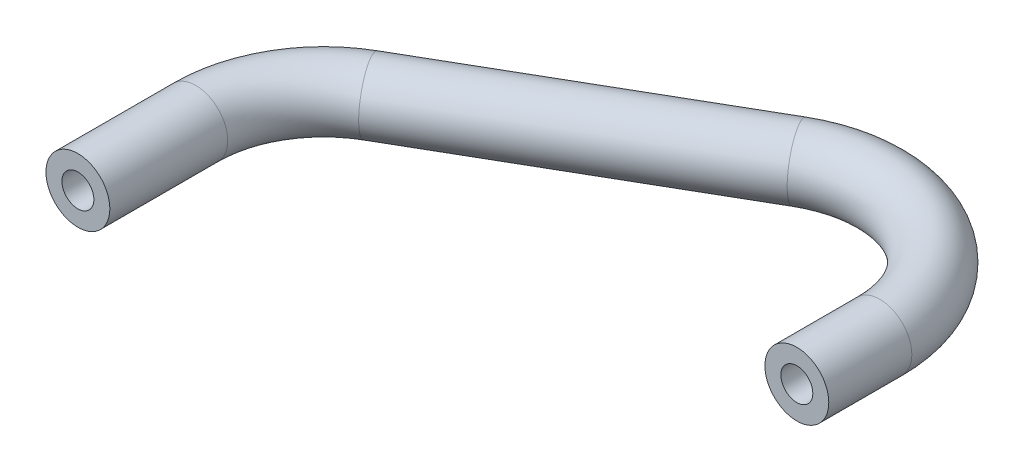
ISO-10303-21;
HEADER;
FILE_DESCRIPTION(('STEP AP214'),'2;1');
FILE_NAME('part.step','',(''),(''),'','','');
FILE_SCHEMA(('AUTOMOTIVE_DESIGN { 1 0 10303 214 1 1 1 1 }'));
ENDSEC;
DATA;
#1=APPLICATION_CONTEXT('core data for automotive mechanical design processes');
#2=APPLICATION_PROTOCOL_DEFINITION('international standard','automotive_design',2000,#1);
#3=PRODUCT_CONTEXT('',#1,'mechanical');
#4=PRODUCT('Part','Part','',(#3));
#5=PRODUCT_RELATED_PRODUCT_CATEGORY('part','',(#4));
#6=PRODUCT_DEFINITION_FORMATION('','',#4);
#7=PRODUCT_DEFINITION_CONTEXT('part definition',#1,'design');
#8=PRODUCT_DEFINITION('design','',#6,#7);
#9=PRODUCT_DEFINITION_SHAPE('','',#8);
#10=(LENGTH_UNIT() NAMED_UNIT(*) SI_UNIT(.MILLI.,.METRE.));
#11=(NAMED_UNIT(*) PLANE_ANGLE_UNIT() SI_UNIT($,.RADIAN.));
#12=(NAMED_UNIT(*) SI_UNIT($,.STERADIAN.) SOLID_ANGLE_UNIT());
#13=UNCERTAINTY_MEASURE_WITH_UNIT(LENGTH_MEASURE(1.E-05),#10,'distance_accuracy_value','');
#14=(GEOMETRIC_REPRESENTATION_CONTEXT(3) GLOBAL_UNCERTAINTY_ASSIGNED_CONTEXT((#13)) GLOBAL_UNIT_ASSIGNED_CONTEXT((#10,
#11,#12)) REPRESENTATION_CONTEXT('',''));
#15=CARTESIAN_POINT('',(0.,0.,0.));
#16=DIRECTION('',(0.,0.,1.));
#17=DIRECTION('',(1.,0.,0.));
#18=AXIS2_PLACEMENT_3D('',#15,#16,#17);
#19=CARTESIAN_POINT('',(52.39455612,0.,-27.3029658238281));
#20=DIRECTION('',(0.,0.,1.));
#21=DIRECTION('',(1.,0.,0.));
#22=AXIS2_PLACEMENT_3D('',#19,#20,#21);
#23=CYLINDRICAL_SURFACE('',#22,3.175);
#24=CARTESIAN_POINT('',(52.39455612,0.,-27.3029658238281));
#25=DIRECTION('',(0.,0.,-1.));
#26=DIRECTION('',(-1.,0.,0.));
#27=AXIS2_PLACEMENT_3D('',#24,#25,#26);
#28=CIRCLE('',#27,3.175);
#29=CARTESIAN_POINT('',(55.56955612,0.,-27.3029658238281));
#30=VERTEX_POINT('',#29);
#31=EDGE_CURVE('E40',#30,#30,#28,.T.);
#32=CARTESIAN_POINT('',(52.39455612,0.,-19.05));
#33=DIRECTION('',(0.,0.,-1.));
#34=DIRECTION('',(-1.,0.,0.));
#35=AXIS2_PLACEMENT_3D('',#32,#33,#34);
#36=CIRCLE('',#35,3.175);
#37=CARTESIAN_POINT('',(55.56955612,0.,-19.05));
#38=VERTEX_POINT('',#37);
#39=EDGE_CURVE('E10',#38,#38,#36,.T.);
#40=CARTESIAN_POINT('',(55.56955612,0.,-27.3029658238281));
#41=CARTESIAN_POINT('',(55.56955612,0.,-27.2169974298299));
#42=CARTESIAN_POINT('',(55.56955612,0.,-27.1310290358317));
#43=CARTESIAN_POINT('',(55.56955612,0.,-26.9590922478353));
#44=CARTESIAN_POINT('',(55.56955612,0.,-26.8731238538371));
#45=CARTESIAN_POINT('',(55.56955612,0.,-26.7011870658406));
#46=CARTESIAN_POINT('',(55.56955612,0.,-26.6152186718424));
#47=CARTESIAN_POINT('',(55.56955612,0.,-26.443281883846));
#48=CARTESIAN_POINT('',(55.56955612,0.,-26.3573134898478));
#49=CARTESIAN_POINT('',(55.56955612,0.,-26.1853767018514));
#50=CARTESIAN_POINT('',(55.56955612,0.,-26.0994083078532));
#51=CARTESIAN_POINT('',(55.56955612,0.,-25.9274715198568));
#52=CARTESIAN_POINT('',(55.56955612,0.,-25.8415031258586));
#53=CARTESIAN_POINT('',(55.56955612,0.,-25.6695663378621));
#54=CARTESIAN_POINT('',(55.56955612,0.,-25.5835979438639));
#55=CARTESIAN_POINT('',(55.56955612,0.,-25.4116611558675));
#56=CARTESIAN_POINT('',(55.56955612,0.,-25.3256927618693));
#57=CARTESIAN_POINT('',(55.56955612,0.,-25.1537559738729));
#58=CARTESIAN_POINT('',(55.56955612,0.,-25.0677875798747));
#59=CARTESIAN_POINT('',(55.56955612,0.,-24.8958507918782));
#60=CARTESIAN_POINT('',(55.56955612,0.,-24.80988239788));
#61=CARTESIAN_POINT('',(55.56955612,0.,-24.6379456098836));
#62=CARTESIAN_POINT('',(55.56955612,0.,-24.5519772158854));
#63=CARTESIAN_POINT('',(55.56955612,0.,-24.380040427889));
#64=CARTESIAN_POINT('',(55.56955612,0.,-24.2940720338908));
#65=CARTESIAN_POINT('',(55.56955612,0.,-24.1221352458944));
#66=CARTESIAN_POINT('',(55.56955612,0.,-24.0361668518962));
#67=CARTESIAN_POINT('',(55.56955612,0.,-23.8642300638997));
#68=CARTESIAN_POINT('',(55.56955612,0.,-23.7782616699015));
#69=CARTESIAN_POINT('',(55.56955612,0.,-23.6063248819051));
#70=CARTESIAN_POINT('',(55.56955612,0.,-23.5203564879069));
#71=CARTESIAN_POINT('',(55.56955612,0.,-23.3484196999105));
#72=CARTESIAN_POINT('',(55.56955612,0.,-23.2624513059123));
#73=CARTESIAN_POINT('',(55.56955612,0.,-23.0905145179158));
#74=CARTESIAN_POINT('',(55.56955612,0.,-23.0045461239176));
#75=CARTESIAN_POINT('',(55.56955612,0.,-22.8326093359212));
#76=CARTESIAN_POINT('',(55.56955612,0.,-22.746640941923));
#77=CARTESIAN_POINT('',(55.56955612,0.,-22.5747041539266));
#78=CARTESIAN_POINT('',(55.56955612,0.,-22.4887357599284));
#79=CARTESIAN_POINT('',(55.56955612,0.,-22.316798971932));
#80=CARTESIAN_POINT('',(55.56955612,0.,-22.2308305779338));
#81=CARTESIAN_POINT('',(55.56955612,0.,-22.0588937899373));
#82=CARTESIAN_POINT('',(55.56955612,0.,-21.9729253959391));
#83=CARTESIAN_POINT('',(55.56955612,0.,-21.8009886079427));
#84=CARTESIAN_POINT('',(55.56955612,0.,-21.7150202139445));
#85=CARTESIAN_POINT('',(55.56955612,0.,-21.5430834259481));
#86=CARTESIAN_POINT('',(55.56955612,0.,-21.4571150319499));
#87=CARTESIAN_POINT('',(55.56955612,0.,-21.2851782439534));
#88=CARTESIAN_POINT('',(55.56955612,0.,-21.1992098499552));
#89=CARTESIAN_POINT('',(55.56955612,0.,-21.0272730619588));
#90=CARTESIAN_POINT('',(55.56955612,0.,-20.9413046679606));
#91=CARTESIAN_POINT('',(55.56955612,0.,-20.7693678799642));
#92=CARTESIAN_POINT('',(55.56955612,0.,-20.683399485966));
#93=CARTESIAN_POINT('',(55.56955612,0.,-20.5114626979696));
#94=CARTESIAN_POINT('',(55.56955612,0.,-20.4254943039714));
#95=CARTESIAN_POINT('',(55.56955612,0.,-20.2535575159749));
#96=CARTESIAN_POINT('',(55.56955612,0.,-20.1675891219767));
#97=CARTESIAN_POINT('',(55.56955612,0.,-19.9956523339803));
#98=CARTESIAN_POINT('',(55.56955612,0.,-19.9096839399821));
#99=CARTESIAN_POINT('',(55.56955612,0.,-19.7377471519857));
#100=CARTESIAN_POINT('',(55.56955612,0.,-19.6517787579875));
#101=CARTESIAN_POINT('',(55.56955612,0.,-19.479841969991));
#102=CARTESIAN_POINT('',(55.56955612,0.,-19.3938735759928));
#103=CARTESIAN_POINT('',(55.56955612,0.,-19.2219367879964));
#104=CARTESIAN_POINT('',(55.56955612,0.,-19.1359683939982));
#105=CARTESIAN_POINT('',(55.56955612,0.,-19.05));
#106=B_SPLINE_CURVE_WITH_KNOTS('',3,(#40,#41,#42,#43,#44,#45,#46,#47,#48,#49,#50,#51,#52,#53,
#54,#55,#56,#57,#58,#59,#60,#61,#62,#63,#64,#65,#66,#67,#68,#69,#70,#71,#72,#73,#74,#75,#76,#77,
#78,#79,#80,#81,#82,#83,#84,#85,#86,#87,#88,#89,#90,#91,#92,#93,#94,#95,#96,#97,#98,#99,#100,
#101,#102,#103,#104,#105),.UNSPECIFIED.,.F.,.F.,(4,2,2,2,2,2,2,2,2,2,2,2,2,2,2,2,2,2,2,2,2,2,2,
2,2,2,2,2,2,2,2,2,4),(0.,0.257905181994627,0.515810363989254,0.773715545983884,1.03162072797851,
1.28952590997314,1.54743109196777,1.8053362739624,2.06324145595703,2.32114663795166,
2.57905181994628,2.83695700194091,3.09486218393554,3.35276736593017,3.6106725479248,
3.86857772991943,4.12648291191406,4.38438809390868,4.64229327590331,4.90019845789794,
5.15810363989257,5.4160088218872,5.67391400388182,5.93181918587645,6.18972436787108,
6.44762954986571,6.70553473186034,6.96343991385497,7.2213450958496,7.47925027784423,
7.73715545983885,7.99506064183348,8.25296582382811),.UNSPECIFIED.);
#107=EDGE_CURVE('BSEAM30',#30,#38,#106,.T.);
#108=ORIENTED_EDGE('',*,*,#31,.F.);
#109=ORIENTED_EDGE('',*,*,#39,.T.);
#110=ORIENTED_EDGE('',*,*,#107,.T.);
#111=ORIENTED_EDGE('',*,*,#107,.F.);
#112=EDGE_LOOP('',(#108,#110,#109,#111));
#113=FACE_BOUND('',#112,.T.);
#114=ADVANCED_FACE('F30',(#113),#23,.T.);
#115=CARTESIAN_POINT('',(52.39455612,0.,-27.3029658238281));
#116=DIRECTION('',(0.,0.,1.));
#117=DIRECTION('',(1.,0.,0.));
#118=AXIS2_PLACEMENT_3D('',#115,#116,#117);
#119=CYLINDRICAL_SURFACE('',#118,1.5875);
#120=CARTESIAN_POINT('',(52.39455612,0.,-27.3029658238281));
#121=DIRECTION('',(0.,0.,-1.));
#122=DIRECTION('',(-1.,0.,0.));
#123=AXIS2_PLACEMENT_3D('',#120,#121,#122);
#124=CIRCLE('',#123,1.5875);
#125=CARTESIAN_POINT('',(53.98205612,0.,-27.3029658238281));
#126=VERTEX_POINT('',#125);
#127=EDGE_CURVE('E44',#126,#126,#124,.T.);
#128=CARTESIAN_POINT('',(52.39455612,0.,-19.05));
#129=DIRECTION('',(0.,0.,-1.));
#130=DIRECTION('',(-1.,0.,0.));
#131=AXIS2_PLACEMENT_3D('',#128,#129,#130);
#132=CIRCLE('',#131,1.5875);
#133=CARTESIAN_POINT('',(53.98205612,0.,-19.05));
#134=VERTEX_POINT('',#133);
#135=EDGE_CURVE('E36',#134,#134,#132,.T.);
#136=CARTESIAN_POINT('',(53.98205612,0.,-27.3029658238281));
#137=CARTESIAN_POINT('',(53.98205612,0.,-27.2169974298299));
#138=CARTESIAN_POINT('',(53.98205612,0.,-27.1310290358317));
#139=CARTESIAN_POINT('',(53.98205612,0.,-26.9590922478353));
#140=CARTESIAN_POINT('',(53.98205612,0.,-26.8731238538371));
#141=CARTESIAN_POINT('',(53.98205612,0.,-26.7011870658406));
#142=CARTESIAN_POINT('',(53.98205612,0.,-26.6152186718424));
#143=CARTESIAN_POINT('',(53.98205612,0.,-26.443281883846));
#144=CARTESIAN_POINT('',(53.98205612,0.,-26.3573134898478));
#145=CARTESIAN_POINT('',(53.98205612,0.,-26.1853767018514));
#146=CARTESIAN_POINT('',(53.98205612,0.,-26.0994083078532));
#147=CARTESIAN_POINT('',(53.98205612,0.,-25.9274715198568));
#148=CARTESIAN_POINT('',(53.98205612,0.,-25.8415031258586));
#149=CARTESIAN_POINT('',(53.98205612,0.,-25.6695663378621));
#150=CARTESIAN_POINT('',(53.98205612,0.,-25.5835979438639));
#151=CARTESIAN_POINT('',(53.98205612,0.,-25.4116611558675));
#152=CARTESIAN_POINT('',(53.98205612,0.,-25.3256927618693));
#153=CARTESIAN_POINT('',(53.98205612,0.,-25.1537559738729));
#154=CARTESIAN_POINT('',(53.98205612,0.,-25.0677875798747));
#155=CARTESIAN_POINT('',(53.98205612,0.,-24.8958507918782));
#156=CARTESIAN_POINT('',(53.98205612,0.,-24.80988239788));
#157=CARTESIAN_POINT('',(53.98205612,0.,-24.6379456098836));
#158=CARTESIAN_POINT('',(53.98205612,0.,-24.5519772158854));
#159=CARTESIAN_POINT('',(53.98205612,0.,-24.380040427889));
#160=CARTESIAN_POINT('',(53.98205612,0.,-24.2940720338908));
#161=CARTESIAN_POINT('',(53.98205612,0.,-24.1221352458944));
#162=CARTESIAN_POINT('',(53.98205612,0.,-24.0361668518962));
#163=CARTESIAN_POINT('',(53.98205612,0.,-23.8642300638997));
#164=CARTESIAN_POINT('',(53.98205612,0.,-23.7782616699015));
#165=CARTESIAN_POINT('',(53.98205612,0.,-23.6063248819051));
#166=CARTESIAN_POINT('',(53.98205612,0.,-23.5203564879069));
#167=CARTESIAN_POINT('',(53.98205612,0.,-23.3484196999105));
#168=CARTESIAN_POINT('',(53.98205612,0.,-23.2624513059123));
#169=CARTESIAN_POINT('',(53.98205612,0.,-23.0905145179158));
#170=CARTESIAN_POINT('',(53.98205612,0.,-23.0045461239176));
#171=CARTESIAN_POINT('',(53.98205612,0.,-22.8326093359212));
#172=CARTESIAN_POINT('',(53.98205612,0.,-22.746640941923));
#173=CARTESIAN_POINT('',(53.98205612,0.,-22.5747041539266));
#174=CARTESIAN_POINT('',(53.98205612,0.,-22.4887357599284));
#175=CARTESIAN_POINT('',(53.98205612,0.,-22.316798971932));
#176=CARTESIAN_POINT('',(53.98205612,0.,-22.2308305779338));
#177=CARTESIAN_POINT('',(53.98205612,0.,-22.0588937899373));
#178=CARTESIAN_POINT('',(53.98205612,0.,-21.9729253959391));
#179=CARTESIAN_POINT('',(53.98205612,0.,-21.8009886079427));
#180=CARTESIAN_POINT('',(53.98205612,0.,-21.7150202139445));
#181=CARTESIAN_POINT('',(53.98205612,0.,-21.5430834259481));
#182=CARTESIAN_POINT('',(53.98205612,0.,-21.4571150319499));
#183=CARTESIAN_POINT('',(53.98205612,0.,-21.2851782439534));
#184=CARTESIAN_POINT('',(53.98205612,0.,-21.1992098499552));
#185=CARTESIAN_POINT('',(53.98205612,0.,-21.0272730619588));
#186=CARTESIAN_POINT('',(53.98205612,0.,-20.9413046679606));
#187=CARTESIAN_POINT('',(53.98205612,0.,-20.7693678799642));
#188=CARTESIAN_POINT('',(53.98205612,0.,-20.683399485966));
#189=CARTESIAN_POINT('',(53.98205612,0.,-20.5114626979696));
#190=CARTESIAN_POINT('',(53.98205612,0.,-20.4254943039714));
#191=CARTESIAN_POINT('',(53.98205612,0.,-20.2535575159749));
#192=CARTESIAN_POINT('',(53.98205612,0.,-20.1675891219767));
#193=CARTESIAN_POINT('',(53.98205612,0.,-19.9956523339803));
#194=CARTESIAN_POINT('',(53.98205612,0.,-19.9096839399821));
#195=CARTESIAN_POINT('',(53.98205612,0.,-19.7377471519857));
#196=CARTESIAN_POINT('',(53.98205612,0.,-19.6517787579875));
#197=CARTESIAN_POINT('',(53.98205612,0.,-19.479841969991));
#198=CARTESIAN_POINT('',(53.98205612,0.,-19.3938735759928));
#199=CARTESIAN_POINT('',(53.98205612,0.,-19.2219367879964));
#200=CARTESIAN_POINT('',(53.98205612,0.,-19.1359683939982));
#201=CARTESIAN_POINT('',(53.98205612,0.,-19.05));
#202=B_SPLINE_CURVE_WITH_KNOTS('',3,(#136,#137,#138,#139,#140,#141,#142,#143,#144,#145,#146,
#147,#148,#149,#150,#151,#152,#153,#154,#155,#156,#157,#158,#159,#160,#161,#162,#163,#164,#165,
#166,#167,#168,#169,#170,#171,#172,#173,#174,#175,#176,#177,#178,#179,#180,#181,#182,#183,#184,
#185,#186,#187,#188,#189,#190,#191,#192,#193,#194,#195,#196,#197,#198,#199,#200,#201),
.UNSPECIFIED.,.F.,.F.,(4,2,2,2,2,2,2,2,2,2,2,2,2,2,2,2,2,2,2,2,2,2,2,2,2,2,2,2,2,2,2,2,4),(0.,
0.25790518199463,0.515810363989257,0.773715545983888,1.03162072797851,1.28952590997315,
1.54743109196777,1.8053362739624,2.06324145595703,2.32114663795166,2.57905181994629,
2.83695700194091,3.09486218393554,3.35276736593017,3.6106725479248,3.86857772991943,
4.12648291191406,4.38438809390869,4.64229327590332,4.90019845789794,5.15810363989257,
5.4160088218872,5.67391400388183,5.93181918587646,6.18972436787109,6.44762954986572,
6.70553473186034,6.96343991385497,7.2213450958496,7.47925027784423,7.73715545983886,
7.99506064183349,8.25296582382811),.UNSPECIFIED.);
#203=EDGE_CURVE('BSEAM99',#126,#134,#202,.T.);
#204=ORIENTED_EDGE('',*,*,#127,.T.);
#205=ORIENTED_EDGE('',*,*,#135,.F.);
#206=ORIENTED_EDGE('',*,*,#203,.T.);
#207=ORIENTED_EDGE('',*,*,#203,.F.);
#208=EDGE_LOOP('',(#204,#206,#205,#207));
#209=FACE_BOUND('',#208,.T.);
#210=ADVANCED_FACE('F99',(#209),#119,.F.);
#211=CARTESIAN_POINT('',(39.69455612,0.,-27.3029658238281));
#212=DIRECTION('',(0.,-1.,0.));
#213=DIRECTION('',(0.,0.,-1.));
#214=AXIS2_PLACEMENT_3D('',#211,#212,#213);
#215=TOROIDAL_SURFACE('',#214,12.7,3.175);
#216=CARTESIAN_POINT('',(33.34455612,0.,-38.3014884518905));
#217=DIRECTION('',(-0.86602540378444,0.,0.499999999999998));
#218=DIRECTION('',(0.499999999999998,0.,0.86602540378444));
#219=AXIS2_PLACEMENT_3D('',#216,#217,#218);
#220=CIRCLE('',#219,3.175);
#221=CARTESIAN_POINT('',(31.75705612,0.,-41.0511191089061));
#222=VERTEX_POINT('',#221);
#223=EDGE_CURVE('E49',#222,#222,#220,.T.);
#224=CARTESIAN_POINT('',(39.69455612,0.,-27.3029658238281));
#225=DIRECTION('',(0.,-1.,0.));
#226=DIRECTION('',(0.,0.,-1.));
#227=AXIS2_PLACEMENT_3D('',#224,#225,#226);
#228=CIRCLE('',#227,15.875);
#229=EDGE_CURVE('',#222,#30,#228,.T.);
#230=ORIENTED_EDGE('',*,*,#223,.F.);
#231=ORIENTED_EDGE('',*,*,#31,.T.);
#232=ORIENTED_EDGE('',*,*,#229,.T.);
#233=ORIENTED_EDGE('',*,*,#229,.F.);
#234=EDGE_LOOP('',(#230,#232,#231,#233));
#235=FACE_BOUND('',#234,.T.);
#236=ADVANCED_FACE('F104',(#235),#215,.T.);
#237=CARTESIAN_POINT('',(39.69455612,0.,-27.3029658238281));
#238=DIRECTION('',(0.,-1.,0.));
#239=DIRECTION('',(0.,0.,-1.));
#240=AXIS2_PLACEMENT_3D('',#237,#238,#239);
#241=TOROIDAL_SURFACE('',#240,12.7,1.5875);
#242=CARTESIAN_POINT('',(33.34455612,0.,-38.3014884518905));
#243=DIRECTION('',(-0.86602540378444,0.,0.499999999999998));
#244=DIRECTION('',(0.499999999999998,0.,0.86602540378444));
#245=AXIS2_PLACEMENT_3D('',#242,#243,#244);
#246=CIRCLE('',#245,1.5875);
#247=CARTESIAN_POINT('',(32.55080612,0.,-39.6763037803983));
#248=VERTEX_POINT('',#247);
#249=EDGE_CURVE('E52',#248,#248,#246,.T.);
#250=CARTESIAN_POINT('',(39.69455612,0.,-27.3029658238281));
#251=DIRECTION('',(0.,-1.,0.));
#252=DIRECTION('',(0.,0.,-1.));
#253=AXIS2_PLACEMENT_3D('',#250,#251,#252);
#254=CIRCLE('',#253,14.2875);
#255=EDGE_CURVE('',#248,#126,#254,.T.);
#256=ORIENTED_EDGE('',*,*,#249,.T.);
#257=ORIENTED_EDGE('',*,*,#127,.F.);
#258=ORIENTED_EDGE('',*,*,#255,.T.);
#259=ORIENTED_EDGE('',*,*,#255,.F.);
#260=EDGE_LOOP('',(#256,#258,#257,#259));
#261=FACE_BOUND('',#260,.T.);
#262=ADVANCED_FACE('F109',(#261),#241,.F.);
#263=CARTESIAN_POINT('',(6.35000000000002,0.,-22.7161742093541));
#264=DIRECTION('',(0.86602540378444,0.,-0.499999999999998));
#265=DIRECTION('',(-0.499999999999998,0.,-0.86602540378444));
#266=AXIS2_PLACEMENT_3D('',#263,#264,#265);
#267=CYLINDRICAL_SURFACE('',#266,3.175);
#268=CARTESIAN_POINT('',(6.35000000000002,0.,-22.7161742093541));
#269=DIRECTION('',(-0.86602540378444,0.,0.499999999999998));
#270=DIRECTION('',(0.499999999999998,0.,0.86602540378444));
#271=AXIS2_PLACEMENT_3D('',#268,#269,#270);
#272=CIRCLE('',#271,3.175);
#273=CARTESIAN_POINT('',(4.76250000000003,0.,-25.4658048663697));
#274=VERTEX_POINT('',#273);
#275=EDGE_CURVE('E55',#274,#274,#272,.T.);
#276=ORIENTED_EDGE('',*,*,#275,.F.);
#277=EDGE_LOOP('',(#276));
#278=FACE_BOUND('',#277,.T.);
#279=ORIENTED_EDGE('',*,*,#223,.T.);
#280=EDGE_LOOP('',(#279));
#281=FACE_BOUND('',#280,.T.);
#282=ADVANCED_FACE('F115',(#278,#281),#267,.T.);
#283=CARTESIAN_POINT('',(6.35000000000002,0.,-22.7161742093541));
#284=DIRECTION('',(0.86602540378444,0.,-0.499999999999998));
#285=DIRECTION('',(-0.499999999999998,0.,-0.86602540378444));
#286=AXIS2_PLACEMENT_3D('',#283,#284,#285);
#287=CYLINDRICAL_SURFACE('',#286,1.5875);
#288=CARTESIAN_POINT('',(6.35000000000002,0.,-22.7161742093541));
#289=DIRECTION('',(-0.86602540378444,0.,0.499999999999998));
#290=DIRECTION('',(0.499999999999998,0.,0.86602540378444));
#291=AXIS2_PLACEMENT_3D('',#288,#289,#290);
#292=CIRCLE('',#291,1.5875);
#293=CARTESIAN_POINT('',(5.55625000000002,0.,-24.0909895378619));
#294=VERTEX_POINT('',#293);
#295=EDGE_CURVE('E58',#294,#294,#292,.T.);
#296=ORIENTED_EDGE('',*,*,#295,.T.);
#297=EDGE_LOOP('',(#296));
#298=FACE_BOUND('',#297,.T.);
#299=ORIENTED_EDGE('',*,*,#249,.F.);
#300=EDGE_LOOP('',(#299));
#301=FACE_BOUND('',#300,.T.);
#302=ADVANCED_FACE('F122',(#298,#301),#287,.F.);
#303=CARTESIAN_POINT('',(12.7,0.,-11.7176515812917));
#304=DIRECTION('',(0.,-1.,0.));
#305=DIRECTION('',(0.,0.,-1.));
#306=AXIS2_PLACEMENT_3D('',#303,#304,#305);
#307=TOROIDAL_SURFACE('',#306,12.7,3.175);
#308=CARTESIAN_POINT('',(0.,0.,-11.7176515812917));
#309=DIRECTION('',(0.,0.,1.));
#310=DIRECTION('',(1.,0.,0.));
#311=AXIS2_PLACEMENT_3D('',#308,#309,#310);
#312=CIRCLE('',#311,3.175);
#313=CARTESIAN_POINT('',(-3.175,0.,-11.7176515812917));
#314=VERTEX_POINT('',#313);
#315=EDGE_CURVE('E61',#314,#314,#312,.T.);
#316=CARTESIAN_POINT('',(12.7,0.,-11.7176515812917));
#317=DIRECTION('',(0.,-1.,0.));
#318=DIRECTION('',(0.,0.,-1.));
#319=AXIS2_PLACEMENT_3D('',#316,#317,#318);
#320=CIRCLE('',#319,15.875);
#321=EDGE_CURVE('',#314,#274,#320,.T.);
#322=ORIENTED_EDGE('',*,*,#315,.F.);
#323=ORIENTED_EDGE('',*,*,#275,.T.);
#324=ORIENTED_EDGE('',*,*,#321,.T.);
#325=ORIENTED_EDGE('',*,*,#321,.F.);
#326=EDGE_LOOP('',(#322,#324,#323,#325));
#327=FACE_BOUND('',#326,.T.);
#328=ADVANCED_FACE('F126',(#327),#307,.T.);
#329=CARTESIAN_POINT('',(12.7,0.,-11.7176515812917));
#330=DIRECTION('',(0.,-1.,0.));
#331=DIRECTION('',(0.,0.,-1.));
#332=AXIS2_PLACEMENT_3D('',#329,#330,#331);
#333=TOROIDAL_SURFACE('',#332,12.7,1.5875);
#334=CARTESIAN_POINT('',(0.,0.,-11.7176515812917));
#335=DIRECTION('',(0.,0.,1.));
#336=DIRECTION('',(1.,0.,0.));
#337=AXIS2_PLACEMENT_3D('',#334,#335,#336);
#338=CIRCLE('',#337,1.5875);
#339=CARTESIAN_POINT('',(-1.5875,0.,-11.7176515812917));
#340=VERTEX_POINT('',#339);
#341=EDGE_CURVE('E65',#340,#340,#338,.T.);
#342=CARTESIAN_POINT('',(12.7,0.,-11.7176515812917));
#343=DIRECTION('',(0.,-1.,0.));
#344=DIRECTION('',(0.,0.,-1.));
#345=AXIS2_PLACEMENT_3D('',#342,#343,#344);
#346=CIRCLE('',#345,14.2875);
#347=EDGE_CURVE('',#340,#294,#346,.T.);
#348=ORIENTED_EDGE('',*,*,#341,.T.);
#349=ORIENTED_EDGE('',*,*,#295,.F.);
#350=ORIENTED_EDGE('',*,*,#347,.T.);
#351=ORIENTED_EDGE('',*,*,#347,.F.);
#352=EDGE_LOOP('',(#348,#350,#349,#351));
#353=FACE_BOUND('',#352,.T.);
#354=ADVANCED_FACE('F74',(#353),#333,.F.);
#355=CARTESIAN_POINT('',(0.,0.,-11.7176515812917));
#356=DIRECTION('',(0.,0.,1.));
#357=DIRECTION('',(1.,0.,0.));
#358=AXIS2_PLACEMENT_3D('',#355,#356,#357);
#359=CYLINDRICAL_SURFACE('',#358,1.5875);
#360=ORIENTED_EDGE('',*,*,#341,.F.);
#361=EDGE_LOOP('',(#360));
#362=FACE_BOUND('',#361,.T.);
#363=CARTESIAN_POINT('',(0.,0.,0.));
#364=DIRECTION('',(0.,0.,1.));
#365=DIRECTION('',(1.,0.,0.));
#366=AXIS2_PLACEMENT_3D('',#363,#364,#365);
#367=CIRCLE('',#366,1.5875);
#368=CARTESIAN_POINT('',(1.5875,0.,0.));
#369=VERTEX_POINT('',#368);
#370=EDGE_CURVE('E66',#369,#369,#367,.T.);
#371=ORIENTED_EDGE('',*,*,#370,.T.);
#372=EDGE_LOOP('',(#371));
#373=FACE_BOUND('',#372,.T.);
#374=ADVANCED_FACE('F77',(#362,#373),#359,.F.);
#375=CARTESIAN_POINT('',(0.,0.,-11.7176515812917));
#376=DIRECTION('',(0.,0.,1.));
#377=DIRECTION('',(1.,0.,0.));
#378=AXIS2_PLACEMENT_3D('',#375,#376,#377);
#379=CYLINDRICAL_SURFACE('',#378,3.175);
#380=ORIENTED_EDGE('',*,*,#315,.T.);
#381=EDGE_LOOP('',(#380));
#382=FACE_BOUND('',#381,.T.);
#383=CARTESIAN_POINT('',(0.,0.,0.));
#384=DIRECTION('',(0.,0.,1.));
#385=DIRECTION('',(1.,0.,0.));
#386=AXIS2_PLACEMENT_3D('',#383,#384,#385);
#387=CIRCLE('',#386,3.175);
#388=CARTESIAN_POINT('',(3.175,0.,0.));
#389=VERTEX_POINT('',#388);
#390=EDGE_CURVE('E62',#389,#389,#387,.T.);
#391=ORIENTED_EDGE('',*,*,#390,.F.);
#392=EDGE_LOOP('',(#391));
#393=FACE_BOUND('',#392,.T.);
#394=ADVANCED_FACE('F80',(#382,#393),#379,.T.);
#395=CARTESIAN_POINT('',(52.39455612,0.,-19.05));
#396=DIRECTION('',(0.,0.,-1.));
#397=DIRECTION('',(-1.,0.,0.));
#398=AXIS2_PLACEMENT_3D('',#395,#396,#397);
#399=PLANE('',#398);
#400=ORIENTED_EDGE('',*,*,#135,.T.);
#401=EDGE_LOOP('',(#400));
#402=FACE_BOUND('',#401,.T.);
#403=ORIENTED_EDGE('',*,*,#39,.F.);
#404=EDGE_LOOP('',(#403));
#405=FACE_BOUND('',#404,.T.);
#406=ADVANCED_FACE('F87',(#402,#405),#399,.F.);
#407=CARTESIAN_POINT('',(0.,0.,0.));
#408=DIRECTION('',(0.,0.,1.));
#409=DIRECTION('',(1.,0.,0.));
#410=AXIS2_PLACEMENT_3D('',#407,#408,#409);
#411=PLANE('',#410);
#412=ORIENTED_EDGE('',*,*,#370,.F.);
#413=EDGE_LOOP('',(#412));
#414=FACE_BOUND('',#413,.T.);
#415=ORIENTED_EDGE('',*,*,#390,.T.);
#416=EDGE_LOOP('',(#415));
#417=FACE_BOUND('',#416,.T.);
#418=ADVANCED_FACE('F84',(#414,#417),#411,.T.);
#419=CLOSED_SHELL('',(#114,#210,#236,#262,#282,#302,#328,#354,#374,#394,#406,#418));
#420=MANIFOLD_SOLID_BREP('B2',#419);
#421=ADVANCED_BREP_SHAPE_REPRESENTATION('',(#18,#420),#14);
#422=SHAPE_DEFINITION_REPRESENTATION(#9,#421);
ENDSEC;
END-ISO-10303-21;
